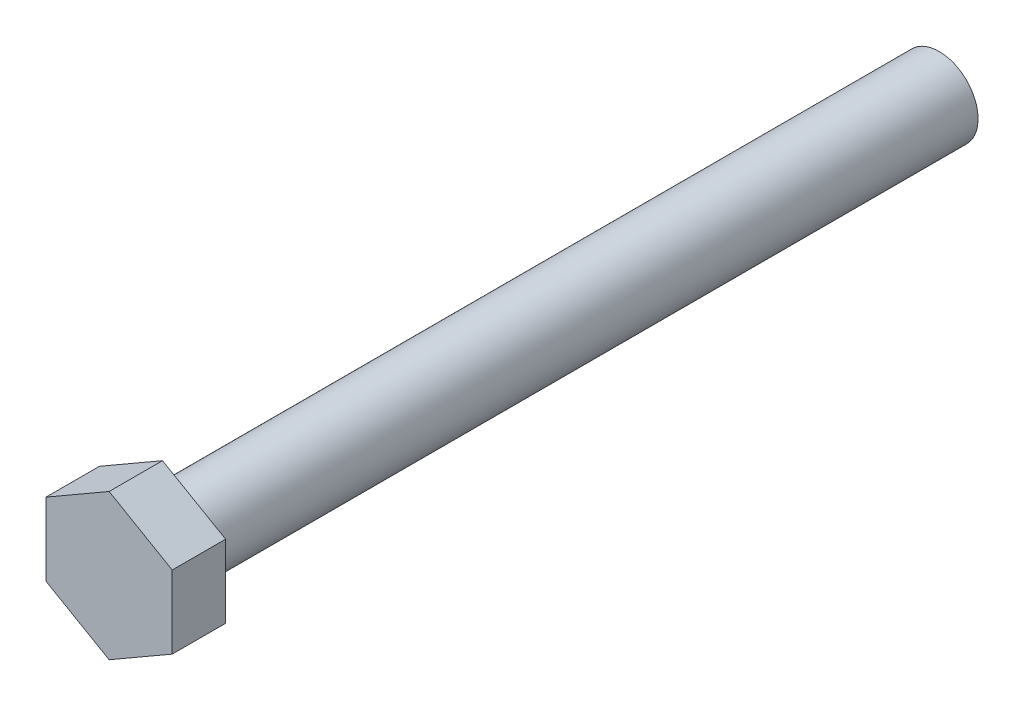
ISO-10303-21;
HEADER;
FILE_DESCRIPTION(('STEP AP214'),'2;1');
FILE_NAME('part.step','',(''),(''),'','','');
FILE_SCHEMA(('AUTOMOTIVE_DESIGN { 1 0 10303 214 1 1 1 1 }'));
ENDSEC;
DATA;
#1=APPLICATION_CONTEXT('core data for automotive mechanical design processes');
#2=APPLICATION_PROTOCOL_DEFINITION('international standard','automotive_design',2000,#1);
#3=PRODUCT_CONTEXT('',#1,'mechanical');
#4=PRODUCT('Part','Part','',(#3));
#5=PRODUCT_RELATED_PRODUCT_CATEGORY('part','',(#4));
#6=PRODUCT_DEFINITION_FORMATION('','',#4);
#7=PRODUCT_DEFINITION_CONTEXT('part definition',#1,'design');
#8=PRODUCT_DEFINITION('design','',#6,#7);
#9=PRODUCT_DEFINITION_SHAPE('','',#8);
#10=(LENGTH_UNIT() NAMED_UNIT(*) SI_UNIT(.MILLI.,.METRE.));
#11=(NAMED_UNIT(*) PLANE_ANGLE_UNIT() SI_UNIT($,.RADIAN.));
#12=(NAMED_UNIT(*) SI_UNIT($,.STERADIAN.) SOLID_ANGLE_UNIT());
#13=UNCERTAINTY_MEASURE_WITH_UNIT(LENGTH_MEASURE(1.E-05),#10,'distance_accuracy_value','');
#14=(GEOMETRIC_REPRESENTATION_CONTEXT(3) GLOBAL_UNCERTAINTY_ASSIGNED_CONTEXT((#13)) GLOBAL_UNIT_ASSIGNED_CONTEXT((#10,
#11,#12)) REPRESENTATION_CONTEXT('',''));
#15=CARTESIAN_POINT('',(0.,0.,0.));
#16=DIRECTION('',(0.,0.,1.));
#17=DIRECTION('',(1.,0.,0.));
#18=AXIS2_PLACEMENT_3D('',#15,#16,#17);
#19=CARTESIAN_POINT('',(0.,7.50555349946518,0.));
#20=DIRECTION('',(0.,0.,1.));
#21=DIRECTION('',(1.,0.,0.));
#22=AXIS2_PLACEMENT_3D('',#19,#20,#21);
#23=PLANE('',#22);
#24=DIRECTION('',(0.866025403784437,0.5,0.));
#25=VECTOR('',#24,1.);
#26=CARTESIAN_POINT('',(-6.5,3.75277674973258,0.));
#27=LINE('',#26,#25);
#28=CARTESIAN_POINT('',(-6.5,3.75277674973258,0.));
#29=VERTEX_POINT('',#28);
#30=CARTESIAN_POINT('',(0.,7.50555349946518,0.));
#31=VERTEX_POINT('',#30);
#32=EDGE_CURVE('E69',#29,#31,#27,.T.);
#33=ORIENTED_EDGE('',*,*,#32,.T.);
#34=DIRECTION('',(-0.866025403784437,0.5,0.));
#35=VECTOR('',#34,1.);
#36=CARTESIAN_POINT('',(6.5,3.75277674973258,0.));
#37=LINE('',#36,#35);
#38=CARTESIAN_POINT('',(6.5,3.75277674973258,0.));
#39=VERTEX_POINT('',#38);
#40=EDGE_CURVE('E83',#39,#31,#37,.T.);
#41=ORIENTED_EDGE('',*,*,#40,.F.);
#42=DIRECTION('',(0.,-1.,0.));
#43=VECTOR('',#42,1.);
#44=CARTESIAN_POINT('',(6.5,3.75277674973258,0.));
#45=LINE('',#44,#43);
#46=CARTESIAN_POINT('',(6.5,-3.75277674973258,0.));
#47=VERTEX_POINT('',#46);
#48=EDGE_CURVE('E90',#39,#47,#45,.T.);
#49=ORIENTED_EDGE('',*,*,#48,.T.);
#50=DIRECTION('',(-0.866025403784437,-0.5,0.));
#51=VECTOR('',#50,1.);
#52=CARTESIAN_POINT('',(6.5,-3.75277674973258,0.));
#53=LINE('',#52,#51);
#54=CARTESIAN_POINT('',(0.,-7.50555349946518,0.));
#55=VERTEX_POINT('',#54);
#56=EDGE_CURVE('E92',#47,#55,#53,.T.);
#57=ORIENTED_EDGE('',*,*,#56,.T.);
#58=DIRECTION('',(0.866025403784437,-0.5,0.));
#59=VECTOR('',#58,1.);
#60=CARTESIAN_POINT('',(-6.5,-3.75277674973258,0.));
#61=LINE('',#60,#59);
#62=CARTESIAN_POINT('',(-6.5,-3.75277674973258,0.));
#63=VERTEX_POINT('',#62);
#64=EDGE_CURVE('E98',#63,#55,#61,.T.);
#65=ORIENTED_EDGE('',*,*,#64,.F.);
#66=DIRECTION('',(0.,-1.,0.));
#67=VECTOR('',#66,1.);
#68=CARTESIAN_POINT('',(-6.5,3.75277674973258,0.));
#69=LINE('',#68,#67);
#70=EDGE_CURVE('E86',#29,#63,#69,.T.);
#71=ORIENTED_EDGE('',*,*,#70,.F.);
#72=EDGE_LOOP('',(#33,#41,#49,#57,#65,#71));
#73=FACE_BOUND('',#72,.T.);
#74=CARTESIAN_POINT('',(0.,0.,0.));
#75=DIRECTION('',(0.,0.,-1.));
#76=DIRECTION('',(-1.,0.,0.));
#77=AXIS2_PLACEMENT_3D('',#74,#75,#76);
#78=CIRCLE('',#77,4.);
#79=CARTESIAN_POINT('',(-4.,0.,0.));
#80=VERTEX_POINT('',#79);
#81=EDGE_CURVE('E9',#80,#80,#78,.T.);
#82=ORIENTED_EDGE('',*,*,#81,.F.);
#83=EDGE_LOOP('',(#82));
#84=FACE_BOUND('',#83,.T.);
#85=ADVANCED_FACE('F14',(#73,#84),#23,.F.);
#86=CARTESIAN_POINT('',(-6.5,3.75277674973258,5.5));
#87=DIRECTION('',(-0.5,0.866025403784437,0.));
#88=DIRECTION('',(-0.866025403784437,-0.5,0.));
#89=AXIS2_PLACEMENT_3D('',#86,#87,#88);
#90=PLANE('',#89);
#91=DIRECTION('',(0.,0.,-1.));
#92=VECTOR('',#91,1.);
#93=CARTESIAN_POINT('',(-6.5,3.75277674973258,5.5));
#94=LINE('',#93,#92);
#95=CARTESIAN_POINT('',(-6.5,3.75277674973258,5.5));
#96=VERTEX_POINT('',#95);
#97=EDGE_CURVE('E18',#96,#29,#94,.T.);
#98=ORIENTED_EDGE('',*,*,#97,.F.);
#99=DIRECTION('',(0.866025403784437,0.5,0.));
#100=VECTOR('',#99,1.);
#101=CARTESIAN_POINT('',(-6.5,3.75277674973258,5.5));
#102=LINE('',#101,#100);
#103=CARTESIAN_POINT('',(0.,7.50555349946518,5.5));
#104=VERTEX_POINT('',#103);
#105=EDGE_CURVE('E71',#96,#104,#102,.T.);
#106=ORIENTED_EDGE('',*,*,#105,.T.);
#107=DIRECTION('',(0.,0.,-1.));
#108=VECTOR('',#107,1.);
#109=CARTESIAN_POINT('',(0.,7.50555349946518,5.5));
#110=LINE('',#109,#108);
#111=EDGE_CURVE('E66',#104,#31,#110,.T.);
#112=ORIENTED_EDGE('',*,*,#111,.T.);
#113=ORIENTED_EDGE('',*,*,#32,.F.);
#114=EDGE_LOOP('',(#98,#106,#112,#113));
#115=FACE_BOUND('',#114,.T.);
#116=ADVANCED_FACE('F68',(#115),#90,.T.);
#117=CARTESIAN_POINT('',(-6.5,3.75277674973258,5.5));
#118=DIRECTION('',(1.,0.,0.));
#119=DIRECTION('',(0.,0.,-1.));
#120=AXIS2_PLACEMENT_3D('',#117,#118,#119);
#121=PLANE('',#120);
#122=DIRECTION('',(0.,0.,-1.));
#123=VECTOR('',#122,1.);
#124=CARTESIAN_POINT('',(-6.5,-3.75277674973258,5.5));
#125=LINE('',#124,#123);
#126=CARTESIAN_POINT('',(-6.5,-3.75277674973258,5.5));
#127=VERTEX_POINT('',#126);
#128=EDGE_CURVE('E37',#127,#63,#125,.T.);
#129=ORIENTED_EDGE('',*,*,#128,.F.);
#130=DIRECTION('',(0.,-1.,0.));
#131=VECTOR('',#130,1.);
#132=CARTESIAN_POINT('',(-6.5,3.75277674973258,5.5));
#133=LINE('',#132,#131);
#134=EDGE_CURVE('E77',#96,#127,#133,.T.);
#135=ORIENTED_EDGE('',*,*,#134,.F.);
#136=ORIENTED_EDGE('',*,*,#97,.T.);
#137=ORIENTED_EDGE('',*,*,#70,.T.);
#138=EDGE_LOOP('',(#129,#135,#136,#137));
#139=FACE_BOUND('',#138,.T.);
#140=ADVANCED_FACE('F16',(#139),#121,.F.);
#141=CARTESIAN_POINT('',(-6.5,-3.75277674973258,5.5));
#142=DIRECTION('',(0.5,0.866025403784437,0.));
#143=DIRECTION('',(-0.866025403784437,0.5,0.));
#144=AXIS2_PLACEMENT_3D('',#141,#142,#143);
#145=PLANE('',#144);
#146=DIRECTION('',(0.,0.,-1.));
#147=VECTOR('',#146,1.);
#148=CARTESIAN_POINT('',(0.,-7.50555349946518,5.5));
#149=LINE('',#148,#147);
#150=CARTESIAN_POINT('',(0.,-7.50555349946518,5.5));
#151=VERTEX_POINT('',#150);
#152=EDGE_CURVE('E119',#151,#55,#149,.T.);
#153=ORIENTED_EDGE('',*,*,#152,.F.);
#154=DIRECTION('',(0.866025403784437,-0.5,0.));
#155=VECTOR('',#154,1.);
#156=CARTESIAN_POINT('',(-6.5,-3.75277674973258,5.5));
#157=LINE('',#156,#155);
#158=EDGE_CURVE('E111',#127,#151,#157,.T.);
#159=ORIENTED_EDGE('',*,*,#158,.F.);
#160=ORIENTED_EDGE('',*,*,#128,.T.);
#161=ORIENTED_EDGE('',*,*,#64,.T.);
#162=EDGE_LOOP('',(#153,#159,#160,#161));
#163=FACE_BOUND('',#162,.T.);
#164=ADVANCED_FACE('F130',(#163),#145,.F.);
#165=CARTESIAN_POINT('',(6.5,-3.75277674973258,5.5));
#166=DIRECTION('',(0.5,-0.866025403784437,0.));
#167=DIRECTION('',(0.866025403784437,0.5,0.));
#168=AXIS2_PLACEMENT_3D('',#165,#166,#167);
#169=PLANE('',#168);
#170=DIRECTION('',(0.,0.,-1.));
#171=VECTOR('',#170,1.);
#172=CARTESIAN_POINT('',(6.5,-3.75277674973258,5.5));
#173=LINE('',#172,#171);
#174=CARTESIAN_POINT('',(6.5,-3.75277674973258,5.5));
#175=VERTEX_POINT('',#174);
#176=EDGE_CURVE('E117',#175,#47,#173,.T.);
#177=ORIENTED_EDGE('',*,*,#176,.F.);
#178=DIRECTION('',(-0.866025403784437,-0.5,0.));
#179=VECTOR('',#178,1.);
#180=CARTESIAN_POINT('',(6.5,-3.75277674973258,5.5));
#181=LINE('',#180,#179);
#182=EDGE_CURVE('E108',#175,#151,#181,.T.);
#183=ORIENTED_EDGE('',*,*,#182,.T.);
#184=ORIENTED_EDGE('',*,*,#152,.T.);
#185=ORIENTED_EDGE('',*,*,#56,.F.);
#186=EDGE_LOOP('',(#177,#183,#184,#185));
#187=FACE_BOUND('',#186,.T.);
#188=ADVANCED_FACE('F129',(#187),#169,.T.);
#189=CARTESIAN_POINT('',(6.5,3.75277674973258,5.5));
#190=DIRECTION('',(1.,0.,0.));
#191=DIRECTION('',(0.,0.,-1.));
#192=AXIS2_PLACEMENT_3D('',#189,#190,#191);
#193=PLANE('',#192);
#194=DIRECTION('',(0.,0.,-1.));
#195=VECTOR('',#194,1.);
#196=CARTESIAN_POINT('',(6.5,3.75277674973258,5.5));
#197=LINE('',#196,#195);
#198=CARTESIAN_POINT('',(6.5,3.75277674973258,5.5));
#199=VERTEX_POINT('',#198);
#200=EDGE_CURVE('E76',#199,#39,#197,.T.);
#201=ORIENTED_EDGE('',*,*,#200,.F.);
#202=DIRECTION('',(0.,-1.,0.));
#203=VECTOR('',#202,1.);
#204=CARTESIAN_POINT('',(6.5,3.75277674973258,5.5));
#205=LINE('',#204,#203);
#206=EDGE_CURVE('E105',#199,#175,#205,.T.);
#207=ORIENTED_EDGE('',*,*,#206,.T.);
#208=ORIENTED_EDGE('',*,*,#176,.T.);
#209=ORIENTED_EDGE('',*,*,#48,.F.);
#210=EDGE_LOOP('',(#201,#207,#208,#209));
#211=FACE_BOUND('',#210,.T.);
#212=ADVANCED_FACE('F126',(#211),#193,.T.);
#213=CARTESIAN_POINT('',(6.5,3.75277674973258,5.5));
#214=DIRECTION('',(-0.5,-0.866025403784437,0.));
#215=DIRECTION('',(0.866025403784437,-0.5,0.));
#216=AXIS2_PLACEMENT_3D('',#213,#214,#215);
#217=PLANE('',#216);
#218=DIRECTION('',(-0.866025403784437,0.5,0.));
#219=VECTOR('',#218,1.);
#220=CARTESIAN_POINT('',(6.5,3.75277674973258,5.5));
#221=LINE('',#220,#219);
#222=EDGE_CURVE('E103',#199,#104,#221,.T.);
#223=ORIENTED_EDGE('',*,*,#222,.F.);
#224=ORIENTED_EDGE('',*,*,#200,.T.);
#225=ORIENTED_EDGE('',*,*,#40,.T.);
#226=ORIENTED_EDGE('',*,*,#111,.F.);
#227=EDGE_LOOP('',(#223,#224,#225,#226));
#228=FACE_BOUND('',#227,.T.);
#229=ADVANCED_FACE('F89',(#228),#217,.F.);
#230=CARTESIAN_POINT('',(0.,7.50555349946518,5.5));
#231=DIRECTION('',(0.,0.,1.));
#232=DIRECTION('',(1.,0.,0.));
#233=AXIS2_PLACEMENT_3D('',#230,#231,#232);
#234=PLANE('',#233);
#235=ORIENTED_EDGE('',*,*,#105,.F.);
#236=ORIENTED_EDGE('',*,*,#134,.T.);
#237=ORIENTED_EDGE('',*,*,#158,.T.);
#238=ORIENTED_EDGE('',*,*,#182,.F.);
#239=ORIENTED_EDGE('',*,*,#206,.F.);
#240=ORIENTED_EDGE('',*,*,#222,.T.);
#241=EDGE_LOOP('',(#235,#236,#237,#238,#239,#240));
#242=FACE_BOUND('',#241,.T.);
#243=ADVANCED_FACE('F122',(#242),#234,.T.);
#244=CARTESIAN_POINT('',(0.,0.,-80.));
#245=DIRECTION('',(0.,0.,1.));
#246=DIRECTION('',(1.,0.,0.));
#247=AXIS2_PLACEMENT_3D('',#244,#245,#246);
#248=CYLINDRICAL_SURFACE('',#247,4.);
#249=CARTESIAN_POINT('',(0.,0.,-80.));
#250=DIRECTION('',(0.,0.,-1.));
#251=DIRECTION('',(-1.,0.,0.));
#252=AXIS2_PLACEMENT_3D('',#249,#250,#251);
#253=CIRCLE('',#252,4.);
#254=CARTESIAN_POINT('',(-4.,0.,-80.));
#255=VERTEX_POINT('',#254);
#256=EDGE_CURVE('E87',#255,#255,#253,.T.);
#257=ORIENTED_EDGE('',*,*,#256,.F.);
#258=EDGE_LOOP('',(#257));
#259=FACE_BOUND('',#258,.T.);
#260=ORIENTED_EDGE('',*,*,#81,.T.);
#261=EDGE_LOOP('',(#260));
#262=FACE_BOUND('',#261,.T.);
#263=ADVANCED_FACE('F148',(#259,#262),#248,.T.);
#264=CARTESIAN_POINT('',(0.,0.,-80.));
#265=DIRECTION('',(0.,0.,-1.));
#266=DIRECTION('',(-1.,0.,0.));
#267=AXIS2_PLACEMENT_3D('',#264,#265,#266);
#268=PLANE('',#267);
#269=ORIENTED_EDGE('',*,*,#256,.T.);
#270=EDGE_LOOP('',(#269));
#271=FACE_BOUND('',#270,.T.);
#272=ADVANCED_FACE('F154',(#271),#268,.T.);
#273=CLOSED_SHELL('',(#85,#116,#140,#164,#188,#212,#229,#243,#263,#272));
#274=MANIFOLD_SOLID_BREP('B1',#273);
#275=ADVANCED_BREP_SHAPE_REPRESENTATION('',(#18,#274),#14);
#276=SHAPE_DEFINITION_REPRESENTATION(#9,#275);
ENDSEC;
END-ISO-10303-21;
